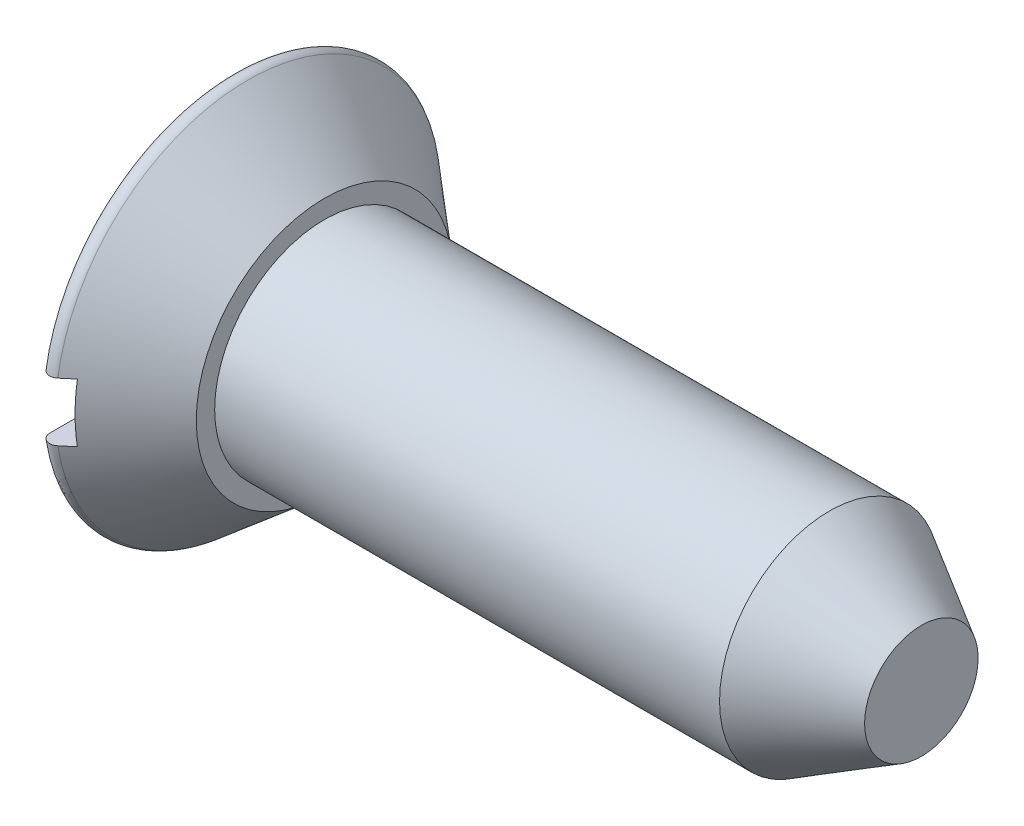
from build123d import *

# Parameters (mm, degrees)
SLOT_CUT_EXTRUDE1_DEPTH      = 6.14257176
SLOT_CUT_EXTRUDE1_DEPTH_BACK = 6.14257176
SKETCH2_W                    = 0.1778
SKETCH2_H                    = 0.4064


with BuildPart() as part:
    # Sketch1 → base-Revolve (revolve)
    with BuildSketch(Plane.XY, mode=Mode.PRIVATE) as base_revolve_sk:
        with BuildLine():
            Line((0, 0), (0, 1.286223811))
            ThreePointArc((0, 1.286223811), (0.03666374, 1.343774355), (0.104317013, 1.334867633))
            Line((0.104317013, 1.334867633), (0.635, 0.889571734))
            Line((0.635, 0.889571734), (0.635, 0.762))
            Line((0.635, 0.762), (4.7752, 0.762))
            Line((4.7752, 0.762), (4.7752, 0))
            Line((4.7752, 0), (0, 0))
        make_face()
    revolve(base_revolve_sk.sketch.rotate(Axis((0, 0, 0), (1, 0, 0)), 90), axis=Axis((0, 0, 0), (1, 0, 0)))

    # Sketch2 → slot_Cut-Extrude1 (cut, two sides: drawn at the far end of the back side and taken through both)
    with BuildSketch(Plane.XY.offset(-SLOT_CUT_EXTRUDE1_DEPTH_BACK)):
        with Locations((0.0889, 0)):
            Rectangle(SKETCH2_W, SKETCH2_H)
    extrude(amount=SLOT_CUT_EXTRUDE1_DEPTH + SLOT_CUT_EXTRUDE1_DEPTH_BACK, mode=Mode.SUBTRACT)

    # Sketch8 → point_Cut-Revolve1 (revolve, cut)
    with BuildSketch(Plane.XY, mode=Mode.PRIVATE) as point_cut_revolve1_sk:
        Polygon((4.7752, 0), (5.2832, 0), (5.2832, 1.27), (4.137285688, 1.27), (4.137285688, 0.762), (4.7752, 0.3937), align=None)
    revolve(point_cut_revolve1_sk.sketch.rotate(Axis((0, 0, 0), (1, 0, 0)), 90), axis=Axis((0, 0, 0), (1, 0, 0)), mode=Mode.SUBTRACT)


solid = part.part
